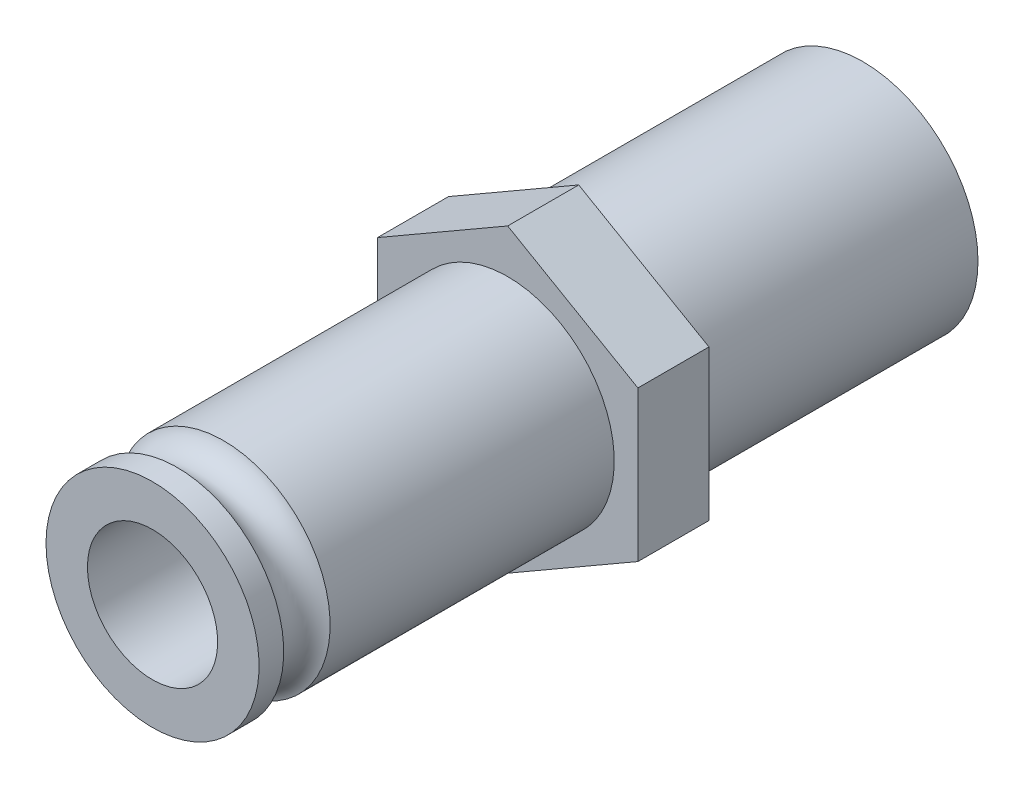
ISO-10303-21;
HEADER;
FILE_DESCRIPTION(('STEP AP214'),'2;1');
FILE_NAME('part.step','',(''),(''),'','','');
FILE_SCHEMA(('AUTOMOTIVE_DESIGN { 1 0 10303 214 1 1 1 1 }'));
ENDSEC;
DATA;
#1=APPLICATION_CONTEXT('core data for automotive mechanical design processes');
#2=APPLICATION_PROTOCOL_DEFINITION('international standard','automotive_design',2000,#1);
#3=PRODUCT_CONTEXT('',#1,'mechanical');
#4=PRODUCT('Part','Part','',(#3));
#5=PRODUCT_RELATED_PRODUCT_CATEGORY('part','',(#4));
#6=PRODUCT_DEFINITION_FORMATION('','',#4);
#7=PRODUCT_DEFINITION_CONTEXT('part definition',#1,'design');
#8=PRODUCT_DEFINITION('design','',#6,#7);
#9=PRODUCT_DEFINITION_SHAPE('','',#8);
#10=(LENGTH_UNIT() NAMED_UNIT(*) SI_UNIT(.MILLI.,.METRE.));
#11=(NAMED_UNIT(*) PLANE_ANGLE_UNIT() SI_UNIT($,.RADIAN.));
#12=(NAMED_UNIT(*) SI_UNIT($,.STERADIAN.) SOLID_ANGLE_UNIT());
#13=UNCERTAINTY_MEASURE_WITH_UNIT(LENGTH_MEASURE(1.E-05),#10,'distance_accuracy_value','');
#14=(GEOMETRIC_REPRESENTATION_CONTEXT(3) GLOBAL_UNCERTAINTY_ASSIGNED_CONTEXT((#13)) GLOBAL_UNIT_ASSIGNED_CONTEXT((#10,
#11,#12)) REPRESENTATION_CONTEXT('',''));
#15=CARTESIAN_POINT('',(0.,0.,0.));
#16=DIRECTION('',(0.,0.,1.));
#17=DIRECTION('',(1.,0.,0.));
#18=AXIS2_PLACEMENT_3D('',#15,#16,#17);
#19=CARTESIAN_POINT('',(0.,0.,12.));
#20=DIRECTION('',(0.,0.,-1.));
#21=DIRECTION('',(-1.,0.,0.));
#22=AXIS2_PLACEMENT_3D('',#19,#20,#21);
#23=CYLINDRICAL_SURFACE('',#22,4.864);
#24=CARTESIAN_POINT('',(0.,0.,12.));
#25=DIRECTION('',(0.,0.,1.));
#26=DIRECTION('',(1.,0.,0.));
#27=AXIS2_PLACEMENT_3D('',#24,#25,#26);
#28=CIRCLE('',#27,4.864);
#29=CARTESIAN_POINT('',(4.864,0.,12.));
#30=VERTEX_POINT('',#29);
#31=EDGE_CURVE('E9',#30,#30,#28,.T.);
#32=ORIENTED_EDGE('',*,*,#31,.F.);
#33=EDGE_LOOP('',(#32));
#34=FACE_BOUND('',#33,.T.);
#35=CARTESIAN_POINT('',(0.,0.,0.));
#36=DIRECTION('',(0.,0.,1.));
#37=DIRECTION('',(1.,0.,0.));
#38=AXIS2_PLACEMENT_3D('',#35,#36,#37);
#39=CIRCLE('',#38,4.864);
#40=CARTESIAN_POINT('',(4.864,0.,0.));
#41=VERTEX_POINT('',#40);
#42=EDGE_CURVE('E18',#41,#41,#39,.T.);
#43=ORIENTED_EDGE('',*,*,#42,.T.);
#44=EDGE_LOOP('',(#43));
#45=FACE_BOUND('',#44,.T.);
#46=ADVANCED_FACE('F15',(#34,#45),#23,.T.);
#47=CARTESIAN_POINT('',(0.,0.,0.));
#48=DIRECTION('',(0.,0.,1.));
#49=DIRECTION('',(1.,0.,0.));
#50=AXIS2_PLACEMENT_3D('',#47,#48,#49);
#51=PLANE('',#50);
#52=CARTESIAN_POINT('',(0.,0.,0.));
#53=DIRECTION('',(0.,0.,-1.));
#54=DIRECTION('',(-1.,0.,0.));
#55=AXIS2_PLACEMENT_3D('',#52,#53,#54);
#56=CIRCLE('',#55,3.5);
#57=CARTESIAN_POINT('',(-3.5,0.,0.));
#58=VERTEX_POINT('',#57);
#59=EDGE_CURVE('E212',#58,#58,#56,.T.);
#60=ORIENTED_EDGE('',*,*,#59,.F.);
#61=EDGE_LOOP('',(#60));
#62=FACE_BOUND('',#61,.T.);
#63=ORIENTED_EDGE('',*,*,#42,.F.);
#64=EDGE_LOOP('',(#63));
#65=FACE_BOUND('',#64,.T.);
#66=ADVANCED_FACE('F124',(#62,#65),#51,.F.);
#67=CARTESIAN_POINT('',(5.5,3.17542648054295,15.));
#68=DIRECTION('',(-0.5,-0.866025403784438,0.));
#69=DIRECTION('',(0.866025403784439,-0.5,0.));
#70=AXIS2_PLACEMENT_3D('',#67,#68,#69);
#71=PLANE('',#70);
#72=DIRECTION('',(-0.866025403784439,0.5,0.));
#73=VECTOR('',#72,1.);
#74=CARTESIAN_POINT('',(5.5,3.17542648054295,12.));
#75=LINE('',#74,#73);
#76=CARTESIAN_POINT('',(5.5,3.17542648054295,12.));
#77=VERTEX_POINT('',#76);
#78=CARTESIAN_POINT('',(0.,6.35085296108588,12.));
#79=VERTEX_POINT('',#78);
#80=EDGE_CURVE('E100',#77,#79,#75,.T.);
#81=ORIENTED_EDGE('',*,*,#80,.T.);
#82=DIRECTION('',(0.,0.,-1.));
#83=VECTOR('',#82,1.);
#84=CARTESIAN_POINT('',(0.,6.35085296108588,15.));
#85=LINE('',#84,#83);
#86=CARTESIAN_POINT('',(0.,6.35085296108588,15.));
#87=VERTEX_POINT('',#86);
#88=EDGE_CURVE('E118',#87,#79,#85,.T.);
#89=ORIENTED_EDGE('',*,*,#88,.F.);
#90=DIRECTION('',(-0.866025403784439,0.5,0.));
#91=VECTOR('',#90,1.);
#92=CARTESIAN_POINT('',(5.5,3.17542648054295,15.));
#93=LINE('',#92,#91);
#94=CARTESIAN_POINT('',(5.5,3.17542648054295,15.));
#95=VERTEX_POINT('',#94);
#96=EDGE_CURVE('E111',#95,#87,#93,.T.);
#97=ORIENTED_EDGE('',*,*,#96,.F.);
#98=DIRECTION('',(0.,0.,-1.));
#99=VECTOR('',#98,1.);
#100=CARTESIAN_POINT('',(5.5,3.17542648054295,15.));
#101=LINE('',#100,#99);
#102=EDGE_CURVE('E96',#95,#77,#101,.T.);
#103=ORIENTED_EDGE('',*,*,#102,.T.);
#104=EDGE_LOOP('',(#81,#89,#97,#103));
#105=FACE_BOUND('',#104,.T.);
#106=ADVANCED_FACE('F126',(#105),#71,.F.);
#107=CARTESIAN_POINT('',(0.,6.35085296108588,15.));
#108=DIRECTION('',(0.5,-0.866025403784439,0.));
#109=DIRECTION('',(0.866025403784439,0.5,0.));
#110=AXIS2_PLACEMENT_3D('',#107,#108,#109);
#111=PLANE('',#110);
#112=DIRECTION('',(-0.866025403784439,-0.5,0.));
#113=VECTOR('',#112,1.);
#114=CARTESIAN_POINT('',(0.,6.35085296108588,12.));
#115=LINE('',#114,#113);
#116=CARTESIAN_POINT('',(-5.5,3.17542648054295,12.));
#117=VERTEX_POINT('',#116);
#118=EDGE_CURVE('E103',#79,#117,#115,.T.);
#119=ORIENTED_EDGE('',*,*,#118,.T.);
#120=DIRECTION('',(0.,0.,-1.));
#121=VECTOR('',#120,1.);
#122=CARTESIAN_POINT('',(-5.5,3.17542648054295,15.));
#123=LINE('',#122,#121);
#124=CARTESIAN_POINT('',(-5.5,3.17542648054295,15.));
#125=VERTEX_POINT('',#124);
#126=EDGE_CURVE('E115',#125,#117,#123,.T.);
#127=ORIENTED_EDGE('',*,*,#126,.F.);
#128=DIRECTION('',(-0.866025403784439,-0.5,0.));
#129=VECTOR('',#128,1.);
#130=CARTESIAN_POINT('',(0.,6.35085296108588,15.));
#131=LINE('',#130,#129);
#132=EDGE_CURVE('E69',#87,#125,#131,.T.);
#133=ORIENTED_EDGE('',*,*,#132,.F.);
#134=ORIENTED_EDGE('',*,*,#88,.T.);
#135=EDGE_LOOP('',(#119,#127,#133,#134));
#136=FACE_BOUND('',#135,.T.);
#137=ADVANCED_FACE('F134',(#136),#111,.F.);
#138=CARTESIAN_POINT('',(-5.5,3.17542648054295,15.));
#139=DIRECTION('',(1.,0.,0.));
#140=DIRECTION('',(0.,0.,-1.));
#141=AXIS2_PLACEMENT_3D('',#138,#139,#140);
#142=PLANE('',#141);
#143=DIRECTION('',(0.,-1.,0.));
#144=VECTOR('',#143,1.);
#145=CARTESIAN_POINT('',(-5.5,3.17542648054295,12.));
#146=LINE('',#145,#144);
#147=CARTESIAN_POINT('',(-5.5,-3.17542648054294,12.));
#148=VERTEX_POINT('',#147);
#149=EDGE_CURVE('E106',#117,#148,#146,.T.);
#150=ORIENTED_EDGE('',*,*,#149,.T.);
#151=DIRECTION('',(0.,0.,-1.));
#152=VECTOR('',#151,1.);
#153=CARTESIAN_POINT('',(-5.5,-3.17542648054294,15.));
#154=LINE('',#153,#152);
#155=CARTESIAN_POINT('',(-5.5,-3.17542648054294,15.));
#156=VERTEX_POINT('',#155);
#157=EDGE_CURVE('E91',#156,#148,#154,.T.);
#158=ORIENTED_EDGE('',*,*,#157,.F.);
#159=DIRECTION('',(0.,-1.,0.));
#160=VECTOR('',#159,1.);
#161=CARTESIAN_POINT('',(-5.5,3.17542648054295,15.));
#162=LINE('',#161,#160);
#163=EDGE_CURVE('E82',#125,#156,#162,.T.);
#164=ORIENTED_EDGE('',*,*,#163,.F.);
#165=ORIENTED_EDGE('',*,*,#126,.T.);
#166=EDGE_LOOP('',(#150,#158,#164,#165));
#167=FACE_BOUND('',#166,.T.);
#168=ADVANCED_FACE('F142',(#167),#142,.F.);
#169=CARTESIAN_POINT('',(-5.5,-3.17542648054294,15.));
#170=DIRECTION('',(0.5,0.866025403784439,0.));
#171=DIRECTION('',(-0.866025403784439,0.5,0.));
#172=AXIS2_PLACEMENT_3D('',#169,#170,#171);
#173=PLANE('',#172);
#174=DIRECTION('',(0.866025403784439,-0.5,0.));
#175=VECTOR('',#174,1.);
#176=CARTESIAN_POINT('',(-5.5,-3.17542648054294,12.));
#177=LINE('',#176,#175);
#178=CARTESIAN_POINT('',(0.,-6.35085296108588,12.));
#179=VERTEX_POINT('',#178);
#180=EDGE_CURVE('E90',#148,#179,#177,.T.);
#181=ORIENTED_EDGE('',*,*,#180,.T.);
#182=DIRECTION('',(0.,0.,-1.));
#183=VECTOR('',#182,1.);
#184=CARTESIAN_POINT('',(0.,-6.35085296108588,15.));
#185=LINE('',#184,#183);
#186=CARTESIAN_POINT('',(0.,-6.35085296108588,15.));
#187=VERTEX_POINT('',#186);
#188=EDGE_CURVE('E87',#187,#179,#185,.T.);
#189=ORIENTED_EDGE('',*,*,#188,.F.);
#190=DIRECTION('',(0.866025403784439,-0.5,0.));
#191=VECTOR('',#190,1.);
#192=CARTESIAN_POINT('',(-5.5,-3.17542648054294,15.));
#193=LINE('',#192,#191);
#194=EDGE_CURVE('E76',#156,#187,#193,.T.);
#195=ORIENTED_EDGE('',*,*,#194,.F.);
#196=ORIENTED_EDGE('',*,*,#157,.T.);
#197=EDGE_LOOP('',(#181,#189,#195,#196));
#198=FACE_BOUND('',#197,.T.);
#199=ADVANCED_FACE('F88',(#198),#173,.F.);
#200=CARTESIAN_POINT('',(0.,-6.35085296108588,15.));
#201=DIRECTION('',(-0.5,0.866025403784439,0.));
#202=DIRECTION('',(-0.866025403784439,-0.5,0.));
#203=AXIS2_PLACEMENT_3D('',#200,#201,#202);
#204=PLANE('',#203);
#205=DIRECTION('',(0.866025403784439,0.5,0.));
#206=VECTOR('',#205,1.);
#207=CARTESIAN_POINT('',(0.,-6.35085296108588,12.));
#208=LINE('',#207,#206);
#209=CARTESIAN_POINT('',(5.5,-3.17542648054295,12.));
#210=VERTEX_POINT('',#209);
#211=EDGE_CURVE('E54',#179,#210,#208,.T.);
#212=ORIENTED_EDGE('',*,*,#211,.T.);
#213=DIRECTION('',(0.,0.,-1.));
#214=VECTOR('',#213,1.);
#215=CARTESIAN_POINT('',(5.5,-3.17542648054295,15.));
#216=LINE('',#215,#214);
#217=CARTESIAN_POINT('',(5.5,-3.17542648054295,15.));
#218=VERTEX_POINT('',#217);
#219=EDGE_CURVE('E92',#218,#210,#216,.T.);
#220=ORIENTED_EDGE('',*,*,#219,.F.);
#221=DIRECTION('',(0.866025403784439,0.5,0.));
#222=VECTOR('',#221,1.);
#223=CARTESIAN_POINT('',(0.,-6.35085296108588,15.));
#224=LINE('',#223,#222);
#225=EDGE_CURVE('E80',#187,#218,#224,.T.);
#226=ORIENTED_EDGE('',*,*,#225,.F.);
#227=ORIENTED_EDGE('',*,*,#188,.T.);
#228=EDGE_LOOP('',(#212,#220,#226,#227));
#229=FACE_BOUND('',#228,.T.);
#230=ADVANCED_FACE('F94',(#229),#204,.F.);
#231=CARTESIAN_POINT('',(5.5,-3.17542648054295,15.));
#232=DIRECTION('',(-1.,0.,0.));
#233=DIRECTION('',(0.,-1.,0.));
#234=AXIS2_PLACEMENT_3D('',#231,#232,#233);
#235=PLANE('',#234);
#236=DIRECTION('',(0.,1.,0.));
#237=VECTOR('',#236,1.);
#238=CARTESIAN_POINT('',(5.5,-3.17542648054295,12.));
#239=LINE('',#238,#237);
#240=EDGE_CURVE('E60',#210,#77,#239,.T.);
#241=ORIENTED_EDGE('',*,*,#240,.T.);
#242=ORIENTED_EDGE('',*,*,#102,.F.);
#243=DIRECTION('',(0.,1.,0.));
#244=VECTOR('',#243,1.);
#245=CARTESIAN_POINT('',(5.5,-3.17542648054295,15.));
#246=LINE('',#245,#244);
#247=EDGE_CURVE('E31',#218,#95,#246,.T.);
#248=ORIENTED_EDGE('',*,*,#247,.F.);
#249=ORIENTED_EDGE('',*,*,#219,.T.);
#250=EDGE_LOOP('',(#241,#242,#248,#249));
#251=FACE_BOUND('',#250,.T.);
#252=ADVANCED_FACE('F150',(#251),#235,.F.);
#253=CARTESIAN_POINT('',(0.,0.,15.));
#254=DIRECTION('',(0.,0.,1.));
#255=DIRECTION('',(1.,0.,0.));
#256=AXIS2_PLACEMENT_3D('',#253,#254,#255);
#257=PLANE('',#256);
#258=CARTESIAN_POINT('',(0.,0.,15.));
#259=DIRECTION('',(0.,0.,-1.));
#260=DIRECTION('',(-1.,0.,0.));
#261=AXIS2_PLACEMENT_3D('',#258,#259,#260);
#262=CIRCLE('',#261,4.5);
#263=CARTESIAN_POINT('',(-4.5,0.,15.));
#264=VERTEX_POINT('',#263);
#265=EDGE_CURVE('E209',#264,#264,#262,.T.);
#266=ORIENTED_EDGE('',*,*,#265,.T.);
#267=EDGE_LOOP('',(#266));
#268=FACE_BOUND('',#267,.T.);
#269=ORIENTED_EDGE('',*,*,#96,.T.);
#270=ORIENTED_EDGE('',*,*,#132,.T.);
#271=ORIENTED_EDGE('',*,*,#163,.T.);
#272=ORIENTED_EDGE('',*,*,#194,.T.);
#273=ORIENTED_EDGE('',*,*,#225,.T.);
#274=ORIENTED_EDGE('',*,*,#247,.T.);
#275=EDGE_LOOP('',(#269,#270,#271,#272,#273,#274));
#276=FACE_BOUND('',#275,.T.);
#277=ADVANCED_FACE('F78',(#268,#276),#257,.T.);
#278=CARTESIAN_POINT('',(0.,0.,12.));
#279=DIRECTION('',(0.,0.,1.));
#280=DIRECTION('',(1.,0.,0.));
#281=AXIS2_PLACEMENT_3D('',#278,#279,#280);
#282=PLANE('',#281);
#283=ORIENTED_EDGE('',*,*,#31,.T.);
#284=EDGE_LOOP('',(#283));
#285=FACE_BOUND('',#284,.T.);
#286=ORIENTED_EDGE('',*,*,#80,.F.);
#287=ORIENTED_EDGE('',*,*,#240,.F.);
#288=ORIENTED_EDGE('',*,*,#211,.F.);
#289=ORIENTED_EDGE('',*,*,#180,.F.);
#290=ORIENTED_EDGE('',*,*,#149,.F.);
#291=ORIENTED_EDGE('',*,*,#118,.F.);
#292=EDGE_LOOP('',(#286,#287,#288,#289,#290,#291));
#293=FACE_BOUND('',#292,.T.);
#294=ADVANCED_FACE('F153',(#285,#293),#282,.F.);
#295=CARTESIAN_POINT('',(0.,0.,15.));
#296=DIRECTION('',(0.,0.,-1.));
#297=DIRECTION('',(-1.,0.,0.));
#298=AXIS2_PLACEMENT_3D('',#295,#296,#297);
#299=CYLINDRICAL_SURFACE('',#298,3.5);
#300=CARTESIAN_POINT('',(0.,0.,15.));
#301=DIRECTION('',(0.,0.,-1.));
#302=DIRECTION('',(-1.,0.,0.));
#303=AXIS2_PLACEMENT_3D('',#300,#301,#302);
#304=CIRCLE('',#303,3.5);
#305=CARTESIAN_POINT('',(-3.5,0.,15.));
#306=VERTEX_POINT('',#305);
#307=EDGE_CURVE('E104',#306,#306,#304,.T.);
#308=ORIENTED_EDGE('',*,*,#307,.F.);
#309=EDGE_LOOP('',(#308));
#310=FACE_BOUND('',#309,.T.);
#311=ORIENTED_EDGE('',*,*,#59,.T.);
#312=EDGE_LOOP('',(#311));
#313=FACE_BOUND('',#312,.T.);
#314=ADVANCED_FACE('F156',(#310,#313),#299,.F.);
#315=CARTESIAN_POINT('',(2.75,0.,15.));
#316=DIRECTION('',(0.,0.,1.));
#317=DIRECTION('',(1.,0.,0.));
#318=AXIS2_PLACEMENT_3D('',#315,#316,#317);
#319=PLANE('',#318);
#320=CARTESIAN_POINT('',(0.,0.,15.));
#321=DIRECTION('',(0.,0.,-1.));
#322=DIRECTION('',(-1.,0.,0.));
#323=AXIS2_PLACEMENT_3D('',#320,#321,#322);
#324=CIRCLE('',#323,2.75);
#325=CARTESIAN_POINT('',(-2.75,0.,15.));
#326=VERTEX_POINT('',#325);
#327=EDGE_CURVE('E196',#326,#326,#324,.T.);
#328=ORIENTED_EDGE('',*,*,#327,.F.);
#329=EDGE_LOOP('',(#328));
#330=FACE_BOUND('',#329,.T.);
#331=ORIENTED_EDGE('',*,*,#307,.T.);
#332=EDGE_LOOP('',(#331));
#333=FACE_BOUND('',#332,.T.);
#334=ADVANCED_FACE('F163',(#330,#333),#319,.F.);
#335=CARTESIAN_POINT('',(0.,0.,0.));
#336=DIRECTION('',(0.,0.,-1.));
#337=DIRECTION('',(-1.,0.,0.));
#338=AXIS2_PLACEMENT_3D('',#335,#336,#337);
#339=CYLINDRICAL_SURFACE('',#338,4.5);
#340=ORIENTED_EDGE('',*,*,#265,.F.);
#341=EDGE_LOOP('',(#340));
#342=FACE_BOUND('',#341,.T.);
#343=CARTESIAN_POINT('',(0.,0.,27.));
#344=DIRECTION('',(0.,0.,-1.));
#345=DIRECTION('',(-1.,0.,0.));
#346=AXIS2_PLACEMENT_3D('',#343,#344,#345);
#347=CIRCLE('',#346,4.5);
#348=CARTESIAN_POINT('',(-4.5,0.,27.));
#349=VERTEX_POINT('',#348);
#350=EDGE_CURVE('E206',#349,#349,#347,.T.);
#351=ORIENTED_EDGE('',*,*,#350,.T.);
#352=EDGE_LOOP('',(#351));
#353=FACE_BOUND('',#352,.T.);
#354=ADVANCED_FACE('F167',(#342,#353),#339,.T.);
#355=CARTESIAN_POINT('',(0.,0.,27.9798751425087));
#356=DIRECTION('',(0.,0.,-1.));
#357=DIRECTION('',(-1.,0.,0.));
#358=AXIS2_PLACEMENT_3D('',#355,#356,#357);
#359=TOROIDAL_SURFACE('',#358,4.80343210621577,1.02578084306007);
#360=ORIENTED_EDGE('',*,*,#350,.F.);
#361=EDGE_LOOP('',(#360));
#362=FACE_BOUND('',#361,.T.);
#363=CARTESIAN_POINT('',(0.,0.,28.9597502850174));
#364=DIRECTION('',(0.,0.,-1.));
#365=DIRECTION('',(-1.,0.,0.));
#366=AXIS2_PLACEMENT_3D('',#363,#364,#365);
#367=CIRCLE('',#366,4.5);
#368=CARTESIAN_POINT('',(-4.5,0.,28.9597502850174));
#369=VERTEX_POINT('',#368);
#370=EDGE_CURVE('E203',#369,#369,#367,.T.);
#371=ORIENTED_EDGE('',*,*,#370,.T.);
#372=EDGE_LOOP('',(#371));
#373=FACE_BOUND('',#372,.T.);
#374=ADVANCED_FACE('F171',(#362,#373),#359,.F.);
#375=CARTESIAN_POINT('',(0.,0.,0.));
#376=DIRECTION('',(0.,0.,-1.));
#377=DIRECTION('',(-1.,0.,0.));
#378=AXIS2_PLACEMENT_3D('',#375,#376,#377);
#379=CYLINDRICAL_SURFACE('',#378,4.5);
#380=ORIENTED_EDGE('',*,*,#370,.F.);
#381=EDGE_LOOP('',(#380));
#382=FACE_BOUND('',#381,.T.);
#383=CARTESIAN_POINT('',(0.,0.,30.));
#384=DIRECTION('',(0.,0.,-1.));
#385=DIRECTION('',(-1.,0.,0.));
#386=AXIS2_PLACEMENT_3D('',#383,#384,#385);
#387=CIRCLE('',#386,4.5);
#388=CARTESIAN_POINT('',(-4.5,0.,30.));
#389=VERTEX_POINT('',#388);
#390=EDGE_CURVE('E198',#389,#389,#387,.T.);
#391=ORIENTED_EDGE('',*,*,#390,.T.);
#392=EDGE_LOOP('',(#391));
#393=FACE_BOUND('',#392,.T.);
#394=ADVANCED_FACE('F175',(#382,#393),#379,.T.);
#395=CARTESIAN_POINT('',(4.5,0.,30.));
#396=DIRECTION('',(0.,0.,-1.));
#397=DIRECTION('',(-1.,0.,0.));
#398=AXIS2_PLACEMENT_3D('',#395,#396,#397);
#399=PLANE('',#398);
#400=ORIENTED_EDGE('',*,*,#390,.F.);
#401=EDGE_LOOP('',(#400));
#402=FACE_BOUND('',#401,.T.);
#403=CARTESIAN_POINT('',(0.,0.,30.));
#404=DIRECTION('',(0.,0.,-1.));
#405=DIRECTION('',(-1.,0.,0.));
#406=AXIS2_PLACEMENT_3D('',#403,#404,#405);
#407=CIRCLE('',#406,2.75);
#408=CARTESIAN_POINT('',(-2.75,0.,30.));
#409=VERTEX_POINT('',#408);
#410=EDGE_CURVE('E193',#409,#409,#407,.T.);
#411=ORIENTED_EDGE('',*,*,#410,.T.);
#412=EDGE_LOOP('',(#411));
#413=FACE_BOUND('',#412,.T.);
#414=ADVANCED_FACE('F179',(#402,#413),#399,.F.);
#415=CARTESIAN_POINT('',(0.,0.,0.));
#416=DIRECTION('',(0.,0.,-1.));
#417=DIRECTION('',(-1.,0.,0.));
#418=AXIS2_PLACEMENT_3D('',#415,#416,#417);
#419=CYLINDRICAL_SURFACE('',#418,2.75);
#420=ORIENTED_EDGE('',*,*,#410,.F.);
#421=EDGE_LOOP('',(#420));
#422=FACE_BOUND('',#421,.T.);
#423=ORIENTED_EDGE('',*,*,#327,.T.);
#424=EDGE_LOOP('',(#423));
#425=FACE_BOUND('',#424,.T.);
#426=ADVANCED_FACE('F183',(#422,#425),#419,.F.);
#427=CLOSED_SHELL('',(#46,#66,#106,#137,#168,#199,#230,#252,#277,#294,#314,#334,#354,#374,#394,
#414,#426));
#428=MANIFOLD_SOLID_BREP('B1',#427);
#429=ADVANCED_BREP_SHAPE_REPRESENTATION('',(#18,#428),#14);
#430=SHAPE_DEFINITION_REPRESENTATION(#9,#429);
ENDSEC;
END-ISO-10303-21;
